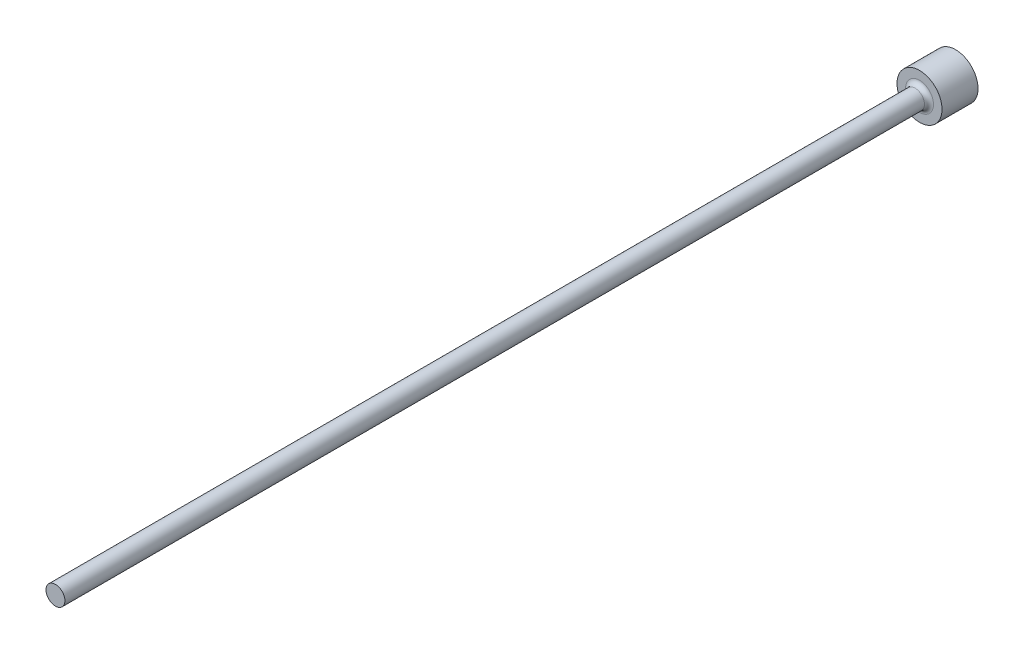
from build123d import *

# Parameters (mm, degrees)
FILLET1_R = 0.5


with BuildPart() as part:
    # FV → Revolve1 (revolve)
    with BuildSketch(Plane(origin=(0, 0, 0), x_dir=(1, 0, 0), z_dir=(0, 1, 0)), mode=Mode.PRIVATE) as revolve1_sk:
        Polygon((0, 0), (2.5, 0), (2.5, -4), (1.05, -4), (1.05, -100), (0, -100), align=None)
    revolve(revolve1_sk.sketch.rotate(Axis((0, 0, -9.033228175), (0, 0, 1)), 180), axis=Axis((0, 0, -9.033228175), (0, 0, 1)))

    # Fillet1
    fillet1_edges = [part.edges().sort_by_distance(p)[0] for p in [
        (1.05, 0, 4),
    ]]
    fillet(fillet1_edges, radius=FILLET1_R)


solid = part.part
